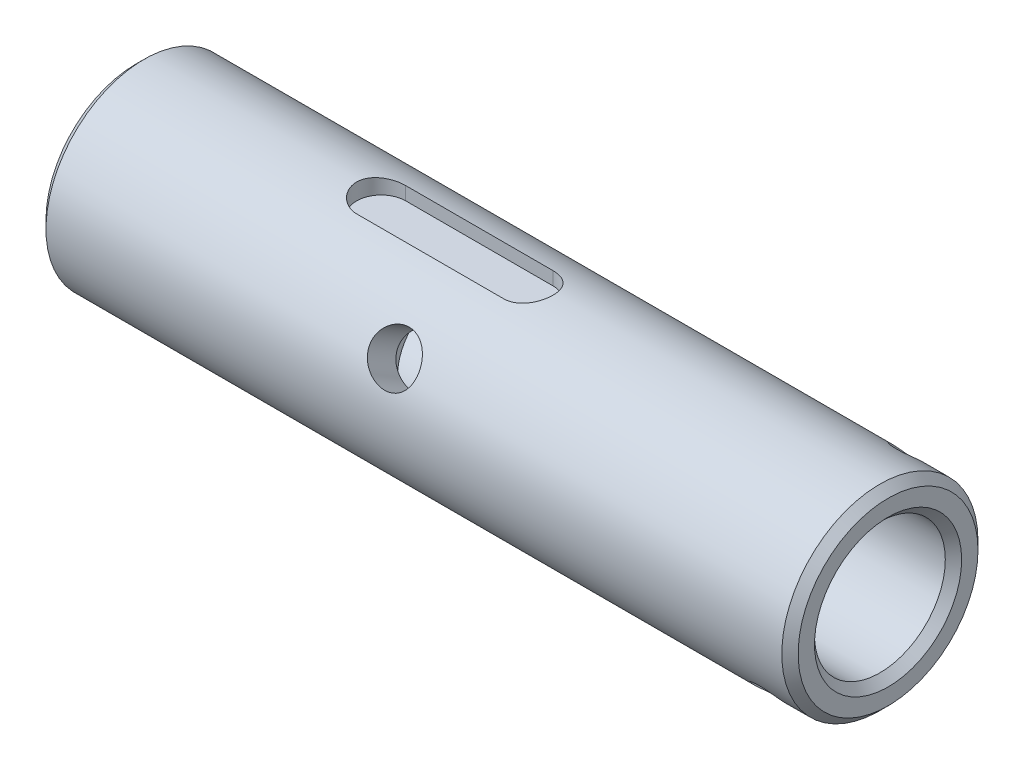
from build123d import *

# Parameters (mm, degrees)
SKETCH_1_R               = 12
SKETCH_1_R_2             = 6
EXTRUDE_1_DEPTH          = 92
CUT_EXTRUDE_1_DEPTH      = 94.552124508
CUT_EXTRUDE_2_DEPTH      = 2
CUT_EXTRUDE_3_REACH      = 97.833
CUT_EXTRUDE_3_END_RADIUS = 6
SKETCH_4_R               = 3
SKETCH_9_R               = 8
CUT_EXTRUDE_4_DEPTH      = 54
CHAMFER_1_SIZE           = 1
CHAMFER_2_SIZE           = 1
CHAMFER_3_SIZE           = 1


with BuildPart() as part:
    # Sketch 1 → Extrude 1 (new body)
    with BuildSketch(Plane(origin=(0, 0, 0), x_dir=(0, 0, -1), z_dir=(1, 0, 0))):
        Circle(SKETCH_1_R)
        Circle(SKETCH_1_R_2, mode=Mode.SUBTRACT)
    extrude(amount=EXTRUDE_1_DEPTH)

    # Sketch 2 → Cut-Extrude 1 (cut, through all)
    with BuildSketch(Plane(origin=(0, 0, 0), x_dir=(1, 0, 0), z_dir=(0, 1, 0))):
        with BuildLine():
            Line((0, 3), (12, 3))
            ThreePointArc((12, 3), (15, 0), (12, -3))
            Line((12, -3), (0, -3))
            Line((0, -3), (0, 3))
        make_face()
    extrude(amount=-CUT_EXTRUDE_1_DEPTH, mode=Mode.SUBTRACT)

    # Sketch 3 → Cut-Extrude 2 (cut)
    with BuildSketch(Plane(origin=(0, 12, 0), x_dir=(-1, 0, 0), z_dir=(0, 1, 0))):
        with BuildLine():
            Line((-48, 3), (-30, 3))
            ThreePointArc((-30, 3), (-27, 0), (-30, -3))
            Line((-30, -3), (-48, -3))
            ThreePointArc((-48, -3), (-51, 0), (-48, 3))
        make_face()
    extrude(amount=-CUT_EXTRUDE_2_DEPTH, mode=Mode.SUBTRACT)

    # Cut-Extrude 3: up to this cylinder (the profile starts outside it)
    cut_extrude_3_end = Plane(origin=(42, 0, 0), z_dir=(-1, 0, 0)) * Cylinder(CUT_EXTRUDE_3_END_RADIUS, 208.666, mode=Mode.PRIVATE)
    # Sketch 4 → Cut-Extrude 3 (cut, up to the surface)
    with BuildSketch(Plane(origin=(0, -12, 0), x_dir=(-1, 0, 0), z_dir=(0, 1, 0)), mode=Mode.PRIVATE) as cut_extrude_3_sk1:
        with Locations(Location((-42, 0, 0), (0, 0, 270))):
            Circle(SKETCH_4_R)
    cut_extrude_3_tool1 = extrude(cut_extrude_3_sk1.sketch, amount=CUT_EXTRUDE_3_REACH, mode=Mode.PRIVATE) - cut_extrude_3_end
    add(cut_extrude_3_tool1.solids().sort_by_distance((42, -12, 0))[0], mode=Mode.SUBTRACT)

    # Sketch 5 → Cut-Revolve 1 (revolve, cut)
    with BuildSketch(Plane.ZY.offset(-42)):
        Polygon((4.128003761, 2.383304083), (5.628003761, -0.214772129), (12.800072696, 3.926023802), (11.300072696, 6.524100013), align=None)
    revolve(axis=Axis((42, 6.524100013, 11.300072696), (0, -0.5000000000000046, -0.8660254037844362)), mode=Mode.SUBTRACT)

    # Sketch 6 → Cut-Revolve 2 (revolve, cut)
    with BuildSketch(Plane.ZY.offset(-42)):
        Polygon((-11.192205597, 6.461822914), (-12.692205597, 3.863746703), (-5.049819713, -0.548586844), (-3.549819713, 2.049489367), align=None)
    revolve(axis=Axis((42, 2.049489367, -3.549819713), (0, 0.5000000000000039, -0.8660254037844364)), mode=Mode.SUBTRACT)

    # Sketch 7 → Cut-Revolve 3 (revolve, cut)
    with BuildSketch(Plane(origin=(86, 0, 0), x_dir=(0, 0, -1), z_dir=(1, 0, 0))):
        Polygon((9.464200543, 9.464200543), (10.878414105, 8.04998698), (-8.074707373, -10.903134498), (-9.488920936, -9.488920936), align=None)
    revolve(axis=Axis((86, -9.488920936, 9.488920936), (0, 0.7071067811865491, -0.707106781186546)), mode=Mode.SUBTRACT)

    # Sketch 9 → Cut-Extrude 4 (cut)
    with BuildSketch(Plane(origin=(92, 0, 0), x_dir=(0, 0, -1), z_dir=(1, 0, 0))):
        Circle(SKETCH_9_R)
    extrude(amount=-CUT_EXTRUDE_4_DEPTH, mode=Mode.SUBTRACT)

    # Chamfer 1
    chamfer_1_edges = [part.edges().sort_by_distance(p)[0] for p in [
        (92, 0, 8),
    ]]
    chamfer(chamfer_1_edges, length=CHAMFER_1_SIZE)

    # Chamfer 2
    chamfer_2_edges = [part.edges().sort_by_distance(p)[0] for p in [
        (92, 0, 12),
    ]]
    chamfer(chamfer_2_edges, length=CHAMFER_2_SIZE)

    # Chamfer 3
    chamfer_3_edges = [part.edges().sort_by_distance(p)[0] for p in [
        (0, 9.486832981, 7.348469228),
    ]]
    chamfer(chamfer_3_edges, length=CHAMFER_3_SIZE)


solid = part.part
